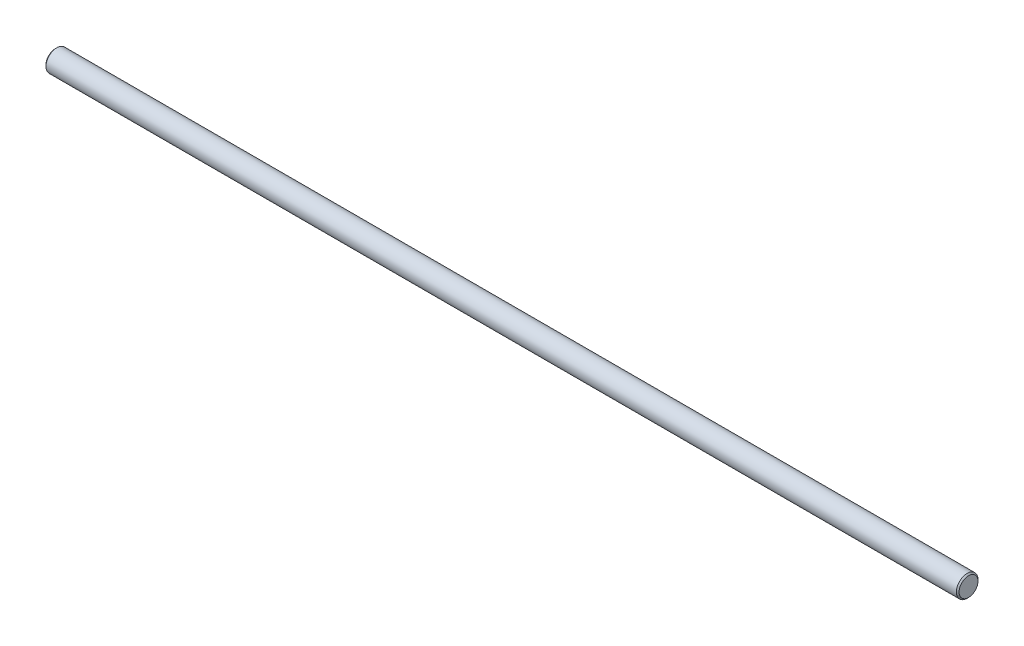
ISO-10303-21;
HEADER;
FILE_DESCRIPTION(('STEP AP214'),'2;1');
FILE_NAME('part.step','',(''),(''),'','','');
FILE_SCHEMA(('AUTOMOTIVE_DESIGN { 1 0 10303 214 1 1 1 1 }'));
ENDSEC;
DATA;
#1=APPLICATION_CONTEXT('core data for automotive mechanical design processes');
#2=APPLICATION_PROTOCOL_DEFINITION('international standard','automotive_design',2000,#1);
#3=PRODUCT_CONTEXT('',#1,'mechanical');
#4=PRODUCT('Part','Part','',(#3));
#5=PRODUCT_RELATED_PRODUCT_CATEGORY('part','',(#4));
#6=PRODUCT_DEFINITION_FORMATION('','',#4);
#7=PRODUCT_DEFINITION_CONTEXT('part definition',#1,'design');
#8=PRODUCT_DEFINITION('design','',#6,#7);
#9=PRODUCT_DEFINITION_SHAPE('','',#8);
#10=(LENGTH_UNIT() NAMED_UNIT(*) SI_UNIT(.MILLI.,.METRE.));
#11=(NAMED_UNIT(*) PLANE_ANGLE_UNIT() SI_UNIT($,.RADIAN.));
#12=(NAMED_UNIT(*) SI_UNIT($,.STERADIAN.) SOLID_ANGLE_UNIT());
#13=UNCERTAINTY_MEASURE_WITH_UNIT(LENGTH_MEASURE(1.E-05),#10,'distance_accuracy_value','');
#14=(GEOMETRIC_REPRESENTATION_CONTEXT(3) GLOBAL_UNCERTAINTY_ASSIGNED_CONTEXT((#13)) GLOBAL_UNIT_ASSIGNED_CONTEXT((#10,
#11,#12)) REPRESENTATION_CONTEXT('',''));
#15=CARTESIAN_POINT('',(0.,0.,0.));
#16=DIRECTION('',(0.,0.,1.));
#17=DIRECTION('',(1.,0.,0.));
#18=AXIS2_PLACEMENT_3D('',#15,#16,#17);
#19=CARTESIAN_POINT('',(169.,0.,0.));
#20=DIRECTION('',(1.,0.,0.));
#21=DIRECTION('',(0.,0.,-1.));
#22=AXIS2_PLACEMENT_3D('',#19,#20,#21);
#23=PLANE('',#22);
#24=CARTESIAN_POINT('',(168.999999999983,0.,0.));
#25=DIRECTION('',(-1.,0.,0.));
#26=DIRECTION('',(0.,0.,1.));
#27=AXIS2_PLACEMENT_3D('',#24,#25,#26);
#28=CIRCLE('',#27,3.50000000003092);
#29=CARTESIAN_POINT('',(168.999999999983,0.,3.50000000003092));
#30=VERTEX_POINT('',#29);
#31=EDGE_CURVE('E18',#30,#30,#28,.T.);
#32=ORIENTED_EDGE('',*,*,#31,.F.);
#33=EDGE_LOOP('',(#32));
#34=FACE_BOUND('',#33,.T.);
#35=ADVANCED_FACE('F15',(#34),#23,.T.);
#36=CARTESIAN_POINT('',(-169.,0.,0.));
#37=DIRECTION('',(1.,0.,0.));
#38=DIRECTION('',(0.,0.,-1.));
#39=AXIS2_PLACEMENT_3D('',#36,#37,#38);
#40=PLANE('',#39);
#41=CARTESIAN_POINT('',(-168.999999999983,0.,0.));
#42=DIRECTION('',(1.,0.,0.));
#43=DIRECTION('',(0.,0.,-1.));
#44=AXIS2_PLACEMENT_3D('',#41,#42,#43);
#45=CIRCLE('',#44,3.50000000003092);
#46=CARTESIAN_POINT('',(-168.999999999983,0.,-3.50000000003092));
#47=VERTEX_POINT('',#46);
#48=EDGE_CURVE('E31',#47,#47,#45,.T.);
#49=ORIENTED_EDGE('',*,*,#48,.F.);
#50=EDGE_LOOP('',(#49));
#51=FACE_BOUND('',#50,.T.);
#52=ADVANCED_FACE('F43',(#51),#40,.F.);
#53=CARTESIAN_POINT('',(168.500000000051,0.,0.));
#54=DIRECTION('',(-1.,0.,0.));
#55=DIRECTION('',(0.,0.,1.));
#56=AXIS2_PLACEMENT_3D('',#53,#54,#55);
#57=CONICAL_SURFACE('',#56,3.99999999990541,0.785398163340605);
#58=CARTESIAN_POINT('',(168.5,0.,0.));
#59=DIRECTION('',(1.,0.,0.));
#60=DIRECTION('',(0.,0.,-1.));
#61=AXIS2_PLACEMENT_3D('',#58,#59,#60);
#62=CIRCLE('',#61,4.);
#63=CARTESIAN_POINT('',(168.5,0.,-4.));
#64=VERTEX_POINT('',#63);
#65=EDGE_CURVE('E23',#64,#64,#62,.F.);
#66=ORIENTED_EDGE('',*,*,#65,.F.);
#67=EDGE_LOOP('',(#66));
#68=FACE_BOUND('',#67,.T.);
#69=ORIENTED_EDGE('',*,*,#31,.T.);
#70=EDGE_LOOP('',(#69));
#71=FACE_BOUND('',#70,.T.);
#72=ADVANCED_FACE('F40',(#68,#71),#57,.T.);
#73=CARTESIAN_POINT('',(-168.500000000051,0.,0.));
#74=DIRECTION('',(1.,0.,0.));
#75=DIRECTION('',(0.,0.,-1.));
#76=AXIS2_PLACEMENT_3D('',#73,#74,#75);
#77=CONICAL_SURFACE('',#76,3.99999999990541,0.785398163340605);
#78=CARTESIAN_POINT('',(-168.5,0.,0.));
#79=DIRECTION('',(1.,0.,0.));
#80=DIRECTION('',(0.,0.,-1.));
#81=AXIS2_PLACEMENT_3D('',#78,#79,#80);
#82=CIRCLE('',#81,4.);
#83=CARTESIAN_POINT('',(-168.5,0.,-4.));
#84=VERTEX_POINT('',#83);
#85=EDGE_CURVE('E10',#84,#84,#82,.T.);
#86=ORIENTED_EDGE('',*,*,#85,.F.);
#87=EDGE_LOOP('',(#86));
#88=FACE_BOUND('',#87,.T.);
#89=ORIENTED_EDGE('',*,*,#48,.T.);
#90=EDGE_LOOP('',(#89));
#91=FACE_BOUND('',#90,.T.);
#92=ADVANCED_FACE('F51',(#88,#91),#77,.T.);
#93=CARTESIAN_POINT('',(-169.,0.,0.));
#94=DIRECTION('',(1.,0.,0.));
#95=DIRECTION('',(0.,0.,-1.));
#96=AXIS2_PLACEMENT_3D('',#93,#94,#95);
#97=CYLINDRICAL_SURFACE('',#96,4.);
#98=ORIENTED_EDGE('',*,*,#65,.T.);
#99=EDGE_LOOP('',(#98));
#100=FACE_BOUND('',#99,.T.);
#101=ORIENTED_EDGE('',*,*,#85,.T.);
#102=EDGE_LOOP('',(#101));
#103=FACE_BOUND('',#102,.T.);
#104=ADVANCED_FACE('F49',(#100,#103),#97,.T.);
#105=CLOSED_SHELL('',(#35,#52,#72,#92,#104));
#106=MANIFOLD_SOLID_BREP('B1',#105);
#107=ADVANCED_BREP_SHAPE_REPRESENTATION('',(#18,#106),#14);
#108=SHAPE_DEFINITION_REPRESENTATION(#9,#107);
ENDSEC;
END-ISO-10303-21;
